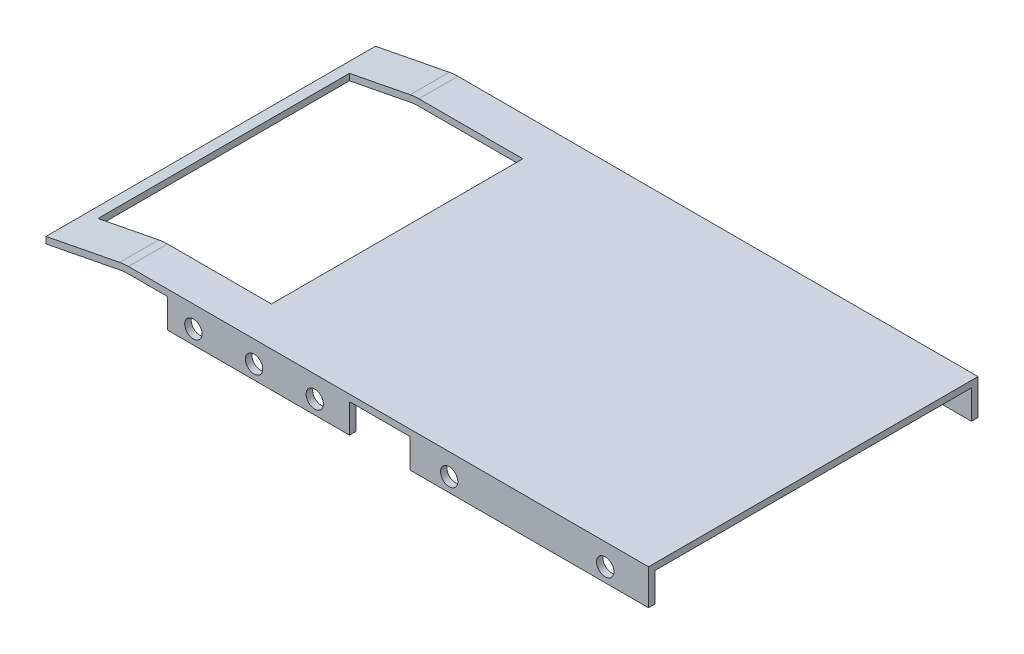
from build123d import *

# Parameters (mm, degrees)
ESQUISSE1_W             = 121
ESQUISSE1_H             = 1.5
EXTRUSION1_DEPTH        = 38
EXTRUSION2_DEPTH        = 38
CONG_2_R                = 8.5
ESQUISSE3_W             = 55
ESQUISSE3_H             = 1.5
ESQUISSE3_W_2           = 42
EXTRUSION3_DEPTH        = 6.7
ESQUISSE4_R             = 2
ENL_V_MAT_EXTRU_1_DEPTH = 144.04506283
ESQUISSE5_W             = 40
ESQUISSE5_H             = 58
ENL_V_MAT_EXTRU_2_DEPTH = 128.091463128
CONG_3_R                = 10.5


with BuildPart() as part:
    # Esquisse1 → Extrusion1 (new, symmetric)
    with BuildSketch(Plane.XY):
        with Locations((60.5, 0.75)):
            Rectangle(ESQUISSE1_W, ESQUISSE1_H)
    extrude(amount=EXTRUSION1_DEPTH, both=True)

    # Esquisse2 → Extrusion2 (add, symmetric)
    with BuildSketch(Plane.XY):
        Polygon((0, 1.5), (-18, -2), (-18, -3.5), (0, 0), align=None)
    extrude(amount=EXTRUSION2_DEPTH, both=True)

    # Cong_2
    cong_2_edges = [part.edges().sort_by_distance(p)[0] for p in [
        (0, 0, 0),
    ]]
    fillet(cong_2_edges, radius=CONG_2_R)

    # Esquisse3 → Extrusion3 (add)
    with BuildSketch(Plane.XZ):
        with Locations((93.5, -37.25)):
            Rectangle(ESQUISSE3_W, ESQUISSE3_H)
        with Locations((31, -37.25)):
            Rectangle(ESQUISSE3_W_2, ESQUISSE3_H)
    extrusion3 = extrude(amount=EXTRUSION3_DEPTH)

    # Sym_trie1: Extrusion3 across plane
    add(extrusion3.mirror(Plane.XY))

    # Esquisse4 → Enl_v. mat.-Extru.1 (cut, through all)
    with BuildSketch(Plane.XY.offset(38)):
        with Locations((30, -3.5)):
            Circle(ESQUISSE4_R)
        with Locations((44, -3.5)):
            Circle(ESQUISSE4_R)
        with Locations((75, -3.5)):
            Circle(ESQUISSE4_R)
        with Locations((111, -3.5)):
            Circle(ESQUISSE4_R)
        with Locations((16, -3.5)):
            Circle(ESQUISSE4_R)
    extrude(amount=-ENL_V_MAT_EXTRU_1_DEPTH, mode=Mode.SUBTRACT)

    # Esquisse5 → Enl_v. mat.-Extru.2 (cut, through all)
    with BuildSketch(Plane(origin=(0, 1.5, 0), x_dir=(-1, 0, 0), z_dir=(0, 1, 0))):
        with Locations((-5, 0)):
            Rectangle(ESQUISSE5_W, ESQUISSE5_H)
    extrude(amount=-ENL_V_MAT_EXTRU_2_DEPTH, mode=Mode.SUBTRACT)

    # Cong_3
    cong_3_edges = [part.edges().sort_by_distance(p)[0] for p in [
        (0, 1.5, -33.5),
        (0, 1.5, 33.5),
    ]]
    fillet(cong_3_edges, radius=CONG_3_R)


solid = part.part
